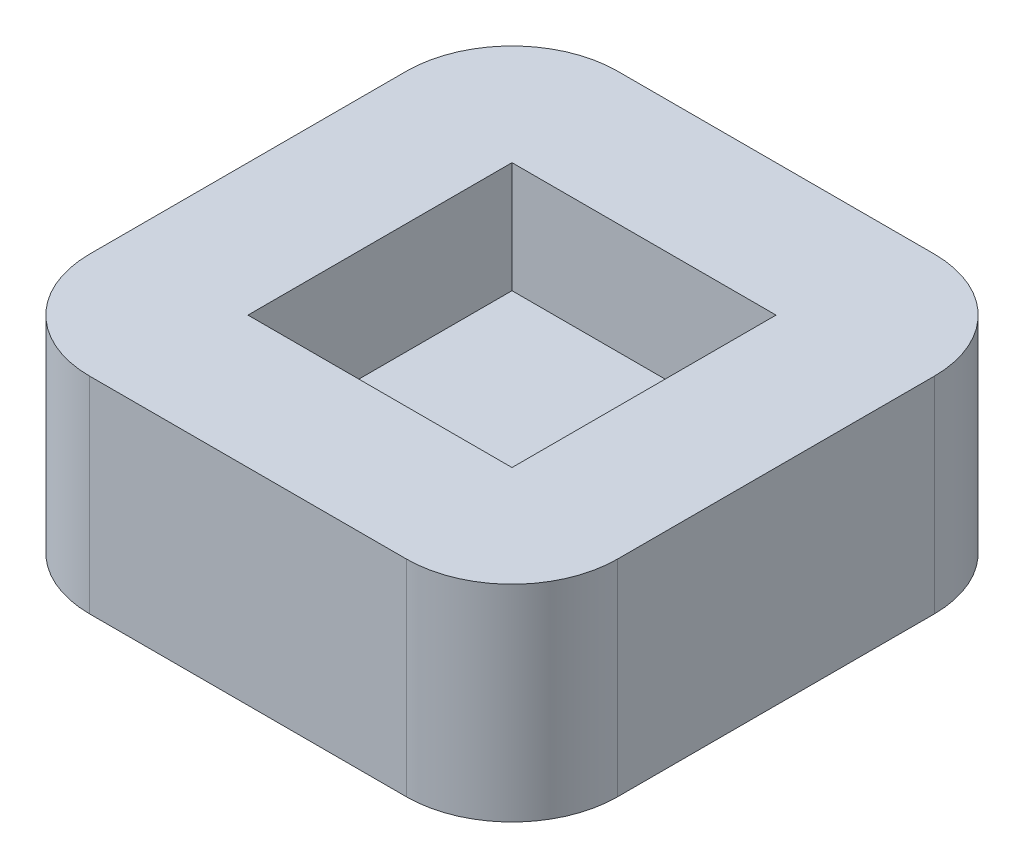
ISO-10303-21;
HEADER;
FILE_DESCRIPTION(('STEP AP214'),'2;1');
FILE_NAME('part.step','',(''),(''),'','','');
FILE_SCHEMA(('AUTOMOTIVE_DESIGN { 1 0 10303 214 1 1 1 1 }'));
ENDSEC;
DATA;
#1=APPLICATION_CONTEXT('core data for automotive mechanical design processes');
#2=APPLICATION_PROTOCOL_DEFINITION('international standard','automotive_design',2000,#1);
#3=PRODUCT_CONTEXT('',#1,'mechanical');
#4=PRODUCT('Part','Part','',(#3));
#5=PRODUCT_RELATED_PRODUCT_CATEGORY('part','',(#4));
#6=PRODUCT_DEFINITION_FORMATION('','',#4);
#7=PRODUCT_DEFINITION_CONTEXT('part definition',#1,'design');
#8=PRODUCT_DEFINITION('design','',#6,#7);
#9=PRODUCT_DEFINITION_SHAPE('','',#8);
#10=(LENGTH_UNIT() NAMED_UNIT(*) SI_UNIT(.MILLI.,.METRE.));
#11=(NAMED_UNIT(*) PLANE_ANGLE_UNIT() SI_UNIT($,.RADIAN.));
#12=(NAMED_UNIT(*) SI_UNIT($,.STERADIAN.) SOLID_ANGLE_UNIT());
#13=UNCERTAINTY_MEASURE_WITH_UNIT(LENGTH_MEASURE(1.E-05),#10,'distance_accuracy_value','');
#14=(GEOMETRIC_REPRESENTATION_CONTEXT(3) GLOBAL_UNCERTAINTY_ASSIGNED_CONTEXT((#13)) GLOBAL_UNIT_ASSIGNED_CONTEXT((#10,
#11,#12)) REPRESENTATION_CONTEXT('',''));
#15=CARTESIAN_POINT('',(0.,0.,0.));
#16=DIRECTION('',(0.,0.,1.));
#17=DIRECTION('',(1.,0.,0.));
#18=AXIS2_PLACEMENT_3D('',#15,#16,#17);
#19=CARTESIAN_POINT('',(-30.,39.,-30.));
#20=DIRECTION('',(0.,-1.,0.));
#21=DIRECTION('',(0.,0.,-1.));
#22=AXIS2_PLACEMENT_3D('',#19,#20,#21);
#23=CYLINDRICAL_SURFACE('',#22,20.);
#24=CARTESIAN_POINT('',(-30.,0.,-30.));
#25=DIRECTION('',(0.,1.,0.));
#26=DIRECTION('',(0.,0.,1.));
#27=AXIS2_PLACEMENT_3D('',#24,#25,#26);
#28=CIRCLE('',#27,20.);
#29=CARTESIAN_POINT('',(-30.,0.,-50.));
#30=VERTEX_POINT('',#29);
#31=CARTESIAN_POINT('',(-50.,0.,-30.));
#32=VERTEX_POINT('',#31);
#33=EDGE_CURVE('E157',#30,#32,#28,.T.);
#34=ORIENTED_EDGE('',*,*,#33,.T.);
#35=DIRECTION('',(0.,-1.,0.));
#36=VECTOR('',#35,1.);
#37=CARTESIAN_POINT('',(-50.,39.,-30.));
#38=LINE('',#37,#36);
#39=CARTESIAN_POINT('',(-50.,39.,-30.));
#40=VERTEX_POINT('',#39);
#41=EDGE_CURVE('E11',#40,#32,#38,.T.);
#42=ORIENTED_EDGE('',*,*,#41,.F.);
#43=CARTESIAN_POINT('',(-30.,39.,-30.));
#44=DIRECTION('',(0.,1.,0.));
#45=DIRECTION('',(0.,0.,1.));
#46=AXIS2_PLACEMENT_3D('',#43,#44,#45);
#47=CIRCLE('',#46,20.);
#48=CARTESIAN_POINT('',(-30.,39.,-50.));
#49=VERTEX_POINT('',#48);
#50=EDGE_CURVE('E176',#49,#40,#47,.T.);
#51=ORIENTED_EDGE('',*,*,#50,.F.);
#52=DIRECTION('',(0.,-1.,0.));
#53=VECTOR('',#52,1.);
#54=CARTESIAN_POINT('',(-30.,39.,-50.));
#55=LINE('',#54,#53);
#56=EDGE_CURVE('E191',#49,#30,#55,.T.);
#57=ORIENTED_EDGE('',*,*,#56,.T.);
#58=EDGE_LOOP('',(#34,#42,#51,#57));
#59=FACE_BOUND('',#58,.T.);
#60=ADVANCED_FACE('F31',(#59),#23,.T.);
#61=CARTESIAN_POINT('',(-50.,39.,-30.));
#62=DIRECTION('',(1.,0.,0.));
#63=DIRECTION('',(0.,0.,-1.));
#64=AXIS2_PLACEMENT_3D('',#61,#62,#63);
#65=PLANE('',#64);
#66=DIRECTION('',(0.,0.,1.));
#67=VECTOR('',#66,1.);
#68=CARTESIAN_POINT('',(-50.,0.,-30.));
#69=LINE('',#68,#67);
#70=CARTESIAN_POINT('',(-50.,0.,30.));
#71=VERTEX_POINT('',#70);
#72=EDGE_CURVE('E162',#32,#71,#69,.T.);
#73=ORIENTED_EDGE('',*,*,#72,.T.);
#74=DIRECTION('',(0.,-1.,0.));
#75=VECTOR('',#74,1.);
#76=CARTESIAN_POINT('',(-50.,39.,30.));
#77=LINE('',#76,#75);
#78=CARTESIAN_POINT('',(-50.,39.,30.));
#79=VERTEX_POINT('',#78);
#80=EDGE_CURVE('E38',#79,#71,#77,.T.);
#81=ORIENTED_EDGE('',*,*,#80,.F.);
#82=DIRECTION('',(0.,0.,1.));
#83=VECTOR('',#82,1.);
#84=CARTESIAN_POINT('',(-50.,39.,-30.));
#85=LINE('',#84,#83);
#86=EDGE_CURVE('E178',#40,#79,#85,.T.);
#87=ORIENTED_EDGE('',*,*,#86,.F.);
#88=ORIENTED_EDGE('',*,*,#41,.T.);
#89=EDGE_LOOP('',(#73,#81,#87,#88));
#90=FACE_BOUND('',#89,.T.);
#91=ADVANCED_FACE('F234',(#90),#65,.F.);
#92=CARTESIAN_POINT('',(-30.,39.,30.));
#93=DIRECTION('',(0.,-1.,0.));
#94=DIRECTION('',(0.,0.,-1.));
#95=AXIS2_PLACEMENT_3D('',#92,#93,#94);
#96=CYLINDRICAL_SURFACE('',#95,20.);
#97=CARTESIAN_POINT('',(-30.,0.,30.));
#98=DIRECTION('',(0.,1.,0.));
#99=DIRECTION('',(0.,0.,1.));
#100=AXIS2_PLACEMENT_3D('',#97,#98,#99);
#101=CIRCLE('',#100,20.);
#102=CARTESIAN_POINT('',(-30.,0.,50.));
#103=VERTEX_POINT('',#102);
#104=EDGE_CURVE('E164',#71,#103,#101,.T.);
#105=ORIENTED_EDGE('',*,*,#104,.T.);
#106=DIRECTION('',(0.,-1.,0.));
#107=VECTOR('',#106,1.);
#108=CARTESIAN_POINT('',(-30.,39.,50.));
#109=LINE('',#108,#107);
#110=CARTESIAN_POINT('',(-30.,39.,50.));
#111=VERTEX_POINT('',#110);
#112=EDGE_CURVE('E206',#111,#103,#109,.T.);
#113=ORIENTED_EDGE('',*,*,#112,.F.);
#114=CARTESIAN_POINT('',(-30.,39.,30.));
#115=DIRECTION('',(0.,1.,0.));
#116=DIRECTION('',(0.,0.,1.));
#117=AXIS2_PLACEMENT_3D('',#114,#115,#116);
#118=CIRCLE('',#117,20.);
#119=EDGE_CURVE('E180',#79,#111,#118,.T.);
#120=ORIENTED_EDGE('',*,*,#119,.F.);
#121=ORIENTED_EDGE('',*,*,#80,.T.);
#122=EDGE_LOOP('',(#105,#113,#120,#121));
#123=FACE_BOUND('',#122,.T.);
#124=ADVANCED_FACE('F213',(#123),#96,.T.);
#125=CARTESIAN_POINT('',(-30.,39.,50.));
#126=DIRECTION('',(0.,0.,-1.));
#127=DIRECTION('',(-1.,0.,0.));
#128=AXIS2_PLACEMENT_3D('',#125,#126,#127);
#129=PLANE('',#128);
#130=DIRECTION('',(1.,0.,0.));
#131=VECTOR('',#130,1.);
#132=CARTESIAN_POINT('',(-30.,0.,50.));
#133=LINE('',#132,#131);
#134=CARTESIAN_POINT('',(30.,0.,50.));
#135=VERTEX_POINT('',#134);
#136=EDGE_CURVE('E166',#103,#135,#133,.T.);
#137=ORIENTED_EDGE('',*,*,#136,.T.);
#138=DIRECTION('',(0.,-1.,0.));
#139=VECTOR('',#138,1.);
#140=CARTESIAN_POINT('',(30.,39.,50.));
#141=LINE('',#140,#139);
#142=CARTESIAN_POINT('',(30.,39.,50.));
#143=VERTEX_POINT('',#142);
#144=EDGE_CURVE('E203',#143,#135,#141,.T.);
#145=ORIENTED_EDGE('',*,*,#144,.F.);
#146=DIRECTION('',(1.,0.,0.));
#147=VECTOR('',#146,1.);
#148=CARTESIAN_POINT('',(-30.,39.,50.));
#149=LINE('',#148,#147);
#150=EDGE_CURVE('E182',#111,#143,#149,.T.);
#151=ORIENTED_EDGE('',*,*,#150,.F.);
#152=ORIENTED_EDGE('',*,*,#112,.T.);
#153=EDGE_LOOP('',(#137,#145,#151,#152));
#154=FACE_BOUND('',#153,.T.);
#155=ADVANCED_FACE('F224',(#154),#129,.F.);
#156=CARTESIAN_POINT('',(30.,39.,30.));
#157=DIRECTION('',(0.,-1.,0.));
#158=DIRECTION('',(0.,0.,-1.));
#159=AXIS2_PLACEMENT_3D('',#156,#157,#158);
#160=CYLINDRICAL_SURFACE('',#159,20.);
#161=CARTESIAN_POINT('',(30.,0.,30.));
#162=DIRECTION('',(0.,1.,0.));
#163=DIRECTION('',(0.,0.,1.));
#164=AXIS2_PLACEMENT_3D('',#161,#162,#163);
#165=CIRCLE('',#164,20.);
#166=CARTESIAN_POINT('',(50.,0.,30.));
#167=VERTEX_POINT('',#166);
#168=EDGE_CURVE('E168',#135,#167,#165,.T.);
#169=ORIENTED_EDGE('',*,*,#168,.T.);
#170=DIRECTION('',(0.,-1.,0.));
#171=VECTOR('',#170,1.);
#172=CARTESIAN_POINT('',(50.,39.,30.));
#173=LINE('',#172,#171);
#174=CARTESIAN_POINT('',(50.,39.,30.));
#175=VERTEX_POINT('',#174);
#176=EDGE_CURVE('E200',#175,#167,#173,.T.);
#177=ORIENTED_EDGE('',*,*,#176,.F.);
#178=CARTESIAN_POINT('',(30.,39.,30.));
#179=DIRECTION('',(0.,1.,0.));
#180=DIRECTION('',(0.,0.,1.));
#181=AXIS2_PLACEMENT_3D('',#178,#179,#180);
#182=CIRCLE('',#181,20.);
#183=EDGE_CURVE('E184',#143,#175,#182,.T.);
#184=ORIENTED_EDGE('',*,*,#183,.F.);
#185=ORIENTED_EDGE('',*,*,#144,.T.);
#186=EDGE_LOOP('',(#169,#177,#184,#185));
#187=FACE_BOUND('',#186,.T.);
#188=ADVANCED_FACE('F228',(#187),#160,.T.);
#189=CARTESIAN_POINT('',(50.,39.,-30.));
#190=DIRECTION('',(-1.,0.,0.));
#191=DIRECTION('',(0.,0.,1.));
#192=AXIS2_PLACEMENT_3D('',#189,#190,#191);
#193=PLANE('',#192);
#194=DIRECTION('',(0.,0.,-1.));
#195=VECTOR('',#194,1.);
#196=CARTESIAN_POINT('',(50.,0.,-30.));
#197=LINE('',#196,#195);
#198=CARTESIAN_POINT('',(50.,0.,-30.));
#199=VERTEX_POINT('',#198);
#200=EDGE_CURVE('E170',#167,#199,#197,.T.);
#201=ORIENTED_EDGE('',*,*,#200,.T.);
#202=DIRECTION('',(0.,-1.,0.));
#203=VECTOR('',#202,1.);
#204=CARTESIAN_POINT('',(50.,39.,-30.));
#205=LINE('',#204,#203);
#206=CARTESIAN_POINT('',(50.,39.,-30.));
#207=VERTEX_POINT('',#206);
#208=EDGE_CURVE('E197',#207,#199,#205,.T.);
#209=ORIENTED_EDGE('',*,*,#208,.F.);
#210=DIRECTION('',(0.,0.,-1.));
#211=VECTOR('',#210,1.);
#212=CARTESIAN_POINT('',(50.,39.,-30.));
#213=LINE('',#212,#211);
#214=EDGE_CURVE('E186',#175,#207,#213,.T.);
#215=ORIENTED_EDGE('',*,*,#214,.F.);
#216=ORIENTED_EDGE('',*,*,#176,.T.);
#217=EDGE_LOOP('',(#201,#209,#215,#216));
#218=FACE_BOUND('',#217,.T.);
#219=ADVANCED_FACE('F245',(#218),#193,.F.);
#220=CARTESIAN_POINT('',(30.,39.,-30.));
#221=DIRECTION('',(0.,-1.,0.));
#222=DIRECTION('',(0.,0.,-1.));
#223=AXIS2_PLACEMENT_3D('',#220,#221,#222);
#224=CYLINDRICAL_SURFACE('',#223,20.);
#225=CARTESIAN_POINT('',(30.,0.,-30.));
#226=DIRECTION('',(0.,1.,0.));
#227=DIRECTION('',(0.,0.,-1.));
#228=AXIS2_PLACEMENT_3D('',#225,#226,#227);
#229=CIRCLE('',#228,20.);
#230=CARTESIAN_POINT('',(30.,0.,-50.));
#231=VERTEX_POINT('',#230);
#232=EDGE_CURVE('E172',#199,#231,#229,.T.);
#233=ORIENTED_EDGE('',*,*,#232,.T.);
#234=DIRECTION('',(0.,-1.,0.));
#235=VECTOR('',#234,1.);
#236=CARTESIAN_POINT('',(30.,39.,-50.));
#237=LINE('',#236,#235);
#238=CARTESIAN_POINT('',(30.,39.,-50.));
#239=VERTEX_POINT('',#238);
#240=EDGE_CURVE('E194',#239,#231,#237,.T.);
#241=ORIENTED_EDGE('',*,*,#240,.F.);
#242=CARTESIAN_POINT('',(30.,39.,-30.));
#243=DIRECTION('',(0.,1.,0.));
#244=DIRECTION('',(0.,0.,-1.));
#245=AXIS2_PLACEMENT_3D('',#242,#243,#244);
#246=CIRCLE('',#245,20.);
#247=EDGE_CURVE('E188',#207,#239,#246,.T.);
#248=ORIENTED_EDGE('',*,*,#247,.F.);
#249=ORIENTED_EDGE('',*,*,#208,.T.);
#250=EDGE_LOOP('',(#233,#241,#248,#249));
#251=FACE_BOUND('',#250,.T.);
#252=ADVANCED_FACE('F243',(#251),#224,.T.);
#253=CARTESIAN_POINT('',(-30.,39.,-50.));
#254=DIRECTION('',(0.,0.,1.));
#255=DIRECTION('',(1.,0.,0.));
#256=AXIS2_PLACEMENT_3D('',#253,#254,#255);
#257=PLANE('',#256);
#258=DIRECTION('',(-1.,0.,0.));
#259=VECTOR('',#258,1.);
#260=CARTESIAN_POINT('',(-30.,0.,-50.));
#261=LINE('',#260,#259);
#262=EDGE_CURVE('E174',#231,#30,#261,.T.);
#263=ORIENTED_EDGE('',*,*,#262,.T.);
#264=ORIENTED_EDGE('',*,*,#56,.F.);
#265=DIRECTION('',(-1.,0.,0.));
#266=VECTOR('',#265,1.);
#267=CARTESIAN_POINT('',(-30.,39.,-50.));
#268=LINE('',#267,#266);
#269=EDGE_CURVE('E53',#239,#49,#268,.T.);
#270=ORIENTED_EDGE('',*,*,#269,.F.);
#271=ORIENTED_EDGE('',*,*,#240,.T.);
#272=EDGE_LOOP('',(#263,#264,#270,#271));
#273=FACE_BOUND('',#272,.T.);
#274=ADVANCED_FACE('F239',(#273),#257,.F.);
#275=CARTESIAN_POINT('',(-30.,39.,-30.));
#276=DIRECTION('',(0.,1.,0.));
#277=DIRECTION('',(0.,0.,1.));
#278=AXIS2_PLACEMENT_3D('',#275,#276,#277);
#279=PLANE('',#278);
#280=DIRECTION('',(0.,0.,1.));
#281=VECTOR('',#280,1.);
#282=CARTESIAN_POINT('',(-25.,39.,-25.));
#283=LINE('',#282,#281);
#284=CARTESIAN_POINT('',(-25.,39.,-25.));
#285=VERTEX_POINT('',#284);
#286=CARTESIAN_POINT('',(-25.,39.,25.));
#287=VERTEX_POINT('',#286);
#288=EDGE_CURVE('E45',#285,#287,#283,.T.);
#289=ORIENTED_EDGE('',*,*,#288,.F.);
#290=DIRECTION('',(-1.,0.,0.));
#291=VECTOR('',#290,1.);
#292=CARTESIAN_POINT('',(-25.,39.,-25.));
#293=LINE('',#292,#291);
#294=CARTESIAN_POINT('',(25.,39.,-25.));
#295=VERTEX_POINT('',#294);
#296=EDGE_CURVE('E141',#295,#285,#293,.T.);
#297=ORIENTED_EDGE('',*,*,#296,.F.);
#298=DIRECTION('',(0.,0.,-1.));
#299=VECTOR('',#298,1.);
#300=CARTESIAN_POINT('',(25.,39.,-25.));
#301=LINE('',#300,#299);
#302=CARTESIAN_POINT('',(25.,39.,25.));
#303=VERTEX_POINT('',#302);
#304=EDGE_CURVE('E124',#303,#295,#301,.T.);
#305=ORIENTED_EDGE('',*,*,#304,.F.);
#306=DIRECTION('',(1.,0.,0.));
#307=VECTOR('',#306,1.);
#308=CARTESIAN_POINT('',(-25.,39.,25.));
#309=LINE('',#308,#307);
#310=EDGE_CURVE('E135',#287,#303,#309,.T.);
#311=ORIENTED_EDGE('',*,*,#310,.F.);
#312=EDGE_LOOP('',(#289,#297,#305,#311));
#313=FACE_BOUND('',#312,.T.);
#314=ORIENTED_EDGE('',*,*,#50,.T.);
#315=ORIENTED_EDGE('',*,*,#86,.T.);
#316=ORIENTED_EDGE('',*,*,#119,.T.);
#317=ORIENTED_EDGE('',*,*,#150,.T.);
#318=ORIENTED_EDGE('',*,*,#183,.T.);
#319=ORIENTED_EDGE('',*,*,#214,.T.);
#320=ORIENTED_EDGE('',*,*,#247,.T.);
#321=ORIENTED_EDGE('',*,*,#269,.T.);
#322=EDGE_LOOP('',(#314,#315,#316,#317,#318,#319,#320,#321));
#323=FACE_BOUND('',#322,.T.);
#324=ADVANCED_FACE('F139',(#313,#323),#279,.T.);
#325=CARTESIAN_POINT('',(-30.,0.,-30.));
#326=DIRECTION('',(0.,1.,0.));
#327=DIRECTION('',(0.,0.,1.));
#328=AXIS2_PLACEMENT_3D('',#325,#326,#327);
#329=PLANE('',#328);
#330=ORIENTED_EDGE('',*,*,#33,.F.);
#331=ORIENTED_EDGE('',*,*,#262,.F.);
#332=ORIENTED_EDGE('',*,*,#232,.F.);
#333=ORIENTED_EDGE('',*,*,#200,.F.);
#334=ORIENTED_EDGE('',*,*,#168,.F.);
#335=ORIENTED_EDGE('',*,*,#136,.F.);
#336=ORIENTED_EDGE('',*,*,#104,.F.);
#337=ORIENTED_EDGE('',*,*,#72,.F.);
#338=EDGE_LOOP('',(#330,#331,#332,#333,#334,#335,#336,#337));
#339=FACE_BOUND('',#338,.T.);
#340=ADVANCED_FACE('F219',(#339),#329,.F.);
#341=CARTESIAN_POINT('',(-25.,18.,-25.));
#342=DIRECTION('',(-1.,0.,0.));
#343=DIRECTION('',(0.,0.,1.));
#344=AXIS2_PLACEMENT_3D('',#341,#342,#343);
#345=PLANE('',#344);
#346=ORIENTED_EDGE('',*,*,#288,.T.);
#347=DIRECTION('',(0.,1.,0.));
#348=VECTOR('',#347,1.);
#349=CARTESIAN_POINT('',(-25.,18.,25.));
#350=LINE('',#349,#348);
#351=CARTESIAN_POINT('',(-25.,18.,25.));
#352=VERTEX_POINT('',#351);
#353=EDGE_CURVE('E132',#352,#287,#350,.T.);
#354=ORIENTED_EDGE('',*,*,#353,.F.);
#355=DIRECTION('',(0.,0.,1.));
#356=VECTOR('',#355,1.);
#357=CARTESIAN_POINT('',(-25.,18.,-25.));
#358=LINE('',#357,#356);
#359=CARTESIAN_POINT('',(-25.,18.,-25.));
#360=VERTEX_POINT('',#359);
#361=EDGE_CURVE('E143',#360,#352,#358,.T.);
#362=ORIENTED_EDGE('',*,*,#361,.F.);
#363=DIRECTION('',(0.,1.,0.));
#364=VECTOR('',#363,1.);
#365=CARTESIAN_POINT('',(-25.,18.,-25.));
#366=LINE('',#365,#364);
#367=EDGE_CURVE('E155',#360,#285,#366,.T.);
#368=ORIENTED_EDGE('',*,*,#367,.T.);
#369=EDGE_LOOP('',(#346,#354,#362,#368));
#370=FACE_BOUND('',#369,.T.);
#371=ADVANCED_FACE('F301',(#370),#345,.F.);
#372=CARTESIAN_POINT('',(-25.,18.,-25.));
#373=DIRECTION('',(0.,0.,-1.));
#374=DIRECTION('',(-1.,0.,0.));
#375=AXIS2_PLACEMENT_3D('',#372,#373,#374);
#376=PLANE('',#375);
#377=ORIENTED_EDGE('',*,*,#296,.T.);
#378=ORIENTED_EDGE('',*,*,#367,.F.);
#379=DIRECTION('',(-1.,0.,0.));
#380=VECTOR('',#379,1.);
#381=CARTESIAN_POINT('',(-25.,18.,-25.));
#382=LINE('',#381,#380);
#383=CARTESIAN_POINT('',(25.,18.,-25.));
#384=VERTEX_POINT('',#383);
#385=EDGE_CURVE('E152',#384,#360,#382,.T.);
#386=ORIENTED_EDGE('',*,*,#385,.F.);
#387=DIRECTION('',(0.,1.,0.));
#388=VECTOR('',#387,1.);
#389=CARTESIAN_POINT('',(25.,18.,-25.));
#390=LINE('',#389,#388);
#391=EDGE_CURVE('E131',#384,#295,#390,.T.);
#392=ORIENTED_EDGE('',*,*,#391,.T.);
#393=EDGE_LOOP('',(#377,#378,#386,#392));
#394=FACE_BOUND('',#393,.T.);
#395=ADVANCED_FACE('F316',(#394),#376,.F.);
#396=CARTESIAN_POINT('',(25.,18.,-25.));
#397=DIRECTION('',(1.,0.,0.));
#398=DIRECTION('',(0.,0.,-1.));
#399=AXIS2_PLACEMENT_3D('',#396,#397,#398);
#400=PLANE('',#399);
#401=ORIENTED_EDGE('',*,*,#304,.T.);
#402=ORIENTED_EDGE('',*,*,#391,.F.);
#403=DIRECTION('',(0.,0.,-1.));
#404=VECTOR('',#403,1.);
#405=CARTESIAN_POINT('',(25.,18.,-25.));
#406=LINE('',#405,#404);
#407=CARTESIAN_POINT('',(25.,18.,25.));
#408=VERTEX_POINT('',#407);
#409=EDGE_CURVE('E127',#408,#384,#406,.T.);
#410=ORIENTED_EDGE('',*,*,#409,.F.);
#411=DIRECTION('',(0.,1.,0.));
#412=VECTOR('',#411,1.);
#413=CARTESIAN_POINT('',(25.,18.,25.));
#414=LINE('',#413,#412);
#415=EDGE_CURVE('E120',#408,#303,#414,.T.);
#416=ORIENTED_EDGE('',*,*,#415,.T.);
#417=EDGE_LOOP('',(#401,#402,#410,#416));
#418=FACE_BOUND('',#417,.T.);
#419=ADVANCED_FACE('F122',(#418),#400,.F.);
#420=CARTESIAN_POINT('',(-25.,18.,25.));
#421=DIRECTION('',(0.,0.,1.));
#422=DIRECTION('',(1.,0.,0.));
#423=AXIS2_PLACEMENT_3D('',#420,#421,#422);
#424=PLANE('',#423);
#425=ORIENTED_EDGE('',*,*,#310,.T.);
#426=ORIENTED_EDGE('',*,*,#415,.F.);
#427=DIRECTION('',(1.,0.,0.));
#428=VECTOR('',#427,1.);
#429=CARTESIAN_POINT('',(-25.,18.,25.));
#430=LINE('',#429,#428);
#431=EDGE_CURVE('E149',#352,#408,#430,.T.);
#432=ORIENTED_EDGE('',*,*,#431,.F.);
#433=ORIENTED_EDGE('',*,*,#353,.T.);
#434=EDGE_LOOP('',(#425,#426,#432,#433));
#435=FACE_BOUND('',#434,.T.);
#436=ADVANCED_FACE('F136',(#435),#424,.F.);
#437=CARTESIAN_POINT('',(-25.,18.,25.));
#438=DIRECTION('',(0.,1.,0.));
#439=DIRECTION('',(0.,0.,1.));
#440=AXIS2_PLACEMENT_3D('',#437,#438,#439);
#441=PLANE('',#440);
#442=ORIENTED_EDGE('',*,*,#361,.T.);
#443=ORIENTED_EDGE('',*,*,#431,.T.);
#444=ORIENTED_EDGE('',*,*,#409,.T.);
#445=ORIENTED_EDGE('',*,*,#385,.T.);
#446=EDGE_LOOP('',(#442,#443,#444,#445));
#447=FACE_BOUND('',#446,.T.);
#448=ADVANCED_FACE('F342',(#447),#441,.T.);
#449=CLOSED_SHELL('',(#60,#91,#124,#155,#188,#219,#252,#274,#324,#340,#371,#395,#419,#436,#448));
#450=MANIFOLD_SOLID_BREP('B2',#449);
#451=ADVANCED_BREP_SHAPE_REPRESENTATION('',(#18,#450),#14);
#452=SHAPE_DEFINITION_REPRESENTATION(#9,#451);
ENDSEC;
END-ISO-10303-21;
